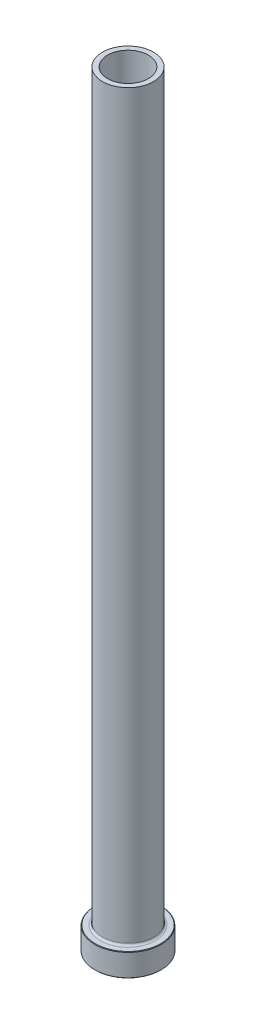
ISO-10303-21;
HEADER;
FILE_DESCRIPTION(('STEP AP214'),'2;1');
FILE_NAME('part.step','',(''),(''),'','','');
FILE_SCHEMA(('AUTOMOTIVE_DESIGN { 1 0 10303 214 1 1 1 1 }'));
ENDSEC;
DATA;
#1=APPLICATION_CONTEXT('core data for automotive mechanical design processes');
#2=APPLICATION_PROTOCOL_DEFINITION('international standard','automotive_design',2000,#1);
#3=PRODUCT_CONTEXT('',#1,'mechanical');
#4=PRODUCT('Part','Part','',(#3));
#5=PRODUCT_RELATED_PRODUCT_CATEGORY('part','',(#4));
#6=PRODUCT_DEFINITION_FORMATION('','',#4);
#7=PRODUCT_DEFINITION_CONTEXT('part definition',#1,'design');
#8=PRODUCT_DEFINITION('design','',#6,#7);
#9=PRODUCT_DEFINITION_SHAPE('','',#8);
#10=(LENGTH_UNIT() NAMED_UNIT(*) SI_UNIT(.MILLI.,.METRE.));
#11=(NAMED_UNIT(*) PLANE_ANGLE_UNIT() SI_UNIT($,.RADIAN.));
#12=(NAMED_UNIT(*) SI_UNIT($,.STERADIAN.) SOLID_ANGLE_UNIT());
#13=UNCERTAINTY_MEASURE_WITH_UNIT(LENGTH_MEASURE(1.E-05),#10,'distance_accuracy_value','');
#14=(GEOMETRIC_REPRESENTATION_CONTEXT(3) GLOBAL_UNCERTAINTY_ASSIGNED_CONTEXT((#13)) GLOBAL_UNIT_ASSIGNED_CONTEXT((#10,
#11,#12)) REPRESENTATION_CONTEXT('',''));
#15=CARTESIAN_POINT('',(0.,0.,0.));
#16=DIRECTION('',(0.,0.,1.));
#17=DIRECTION('',(1.,0.,0.));
#18=AXIS2_PLACEMENT_3D('',#15,#16,#17);
#19=CARTESIAN_POINT('',(0.,92.1876809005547,0.));
#20=DIRECTION('',(0.,1.,0.));
#21=DIRECTION('',(0.,0.,1.));
#22=AXIS2_PLACEMENT_3D('',#19,#20,#21);
#23=CYLINDRICAL_SURFACE('',#22,8.00000000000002);
#24=CARTESIAN_POINT('',(0.,300.,0.));
#25=DIRECTION('',(0.,1.,0.));
#26=DIRECTION('',(0.,0.,1.));
#27=AXIS2_PLACEMENT_3D('',#24,#25,#26);
#28=CIRCLE('',#27,8.00000000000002);
#29=CARTESIAN_POINT('',(0.,300.,8.00000000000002));
#30=VERTEX_POINT('',#29);
#31=EDGE_CURVE('E62',#30,#30,#28,.T.);
#32=ORIENTED_EDGE('',*,*,#31,.T.);
#33=EDGE_LOOP('',(#32));
#34=FACE_BOUND('',#33,.T.);
#35=CARTESIAN_POINT('',(0.,245.,0.));
#36=DIRECTION('',(0.,1.,0.));
#37=DIRECTION('',(0.,0.,1.));
#38=AXIS2_PLACEMENT_3D('',#35,#36,#37);
#39=CIRCLE('',#38,8.00000000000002);
#40=CARTESIAN_POINT('',(0.,245.,8.00000000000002));
#41=VERTEX_POINT('',#40);
#42=EDGE_CURVE('E71',#41,#41,#39,.T.);
#43=ORIENTED_EDGE('',*,*,#42,.F.);
#44=EDGE_LOOP('',(#43));
#45=FACE_BOUND('',#44,.T.);
#46=ADVANCED_FACE('F30',(#34,#45),#23,.F.);
#47=CARTESIAN_POINT('',(-8.00000000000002,300.,0.));
#48=DIRECTION('',(0.,1.,0.));
#49=DIRECTION('',(0.,0.,1.));
#50=AXIS2_PLACEMENT_3D('',#47,#48,#49);
#51=PLANE('',#50);
#52=CARTESIAN_POINT('',(0.,300.,0.));
#53=DIRECTION('',(0.,1.,0.));
#54=DIRECTION('',(0.,0.,1.));
#55=AXIS2_PLACEMENT_3D('',#52,#53,#54);
#56=CIRCLE('',#55,10.);
#57=CARTESIAN_POINT('',(0.,300.,10.));
#58=VERTEX_POINT('',#57);
#59=EDGE_CURVE('E65',#58,#58,#56,.T.);
#60=ORIENTED_EDGE('',*,*,#59,.T.);
#61=EDGE_LOOP('',(#60));
#62=FACE_BOUND('',#61,.T.);
#63=ORIENTED_EDGE('',*,*,#31,.F.);
#64=EDGE_LOOP('',(#63));
#65=FACE_BOUND('',#64,.T.);
#66=ADVANCED_FACE('F79',(#62,#65),#51,.T.);
#67=CARTESIAN_POINT('',(0.,92.1876809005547,0.));
#68=DIRECTION('',(0.,1.,0.));
#69=DIRECTION('',(0.,0.,1.));
#70=AXIS2_PLACEMENT_3D('',#67,#68,#69);
#71=CYLINDRICAL_SURFACE('',#70,10.);
#72=CARTESIAN_POINT('',(0.,9.8,0.));
#73=DIRECTION('',(0.,1.,0.));
#74=DIRECTION('',(0.,0.,1.));
#75=AXIS2_PLACEMENT_3D('',#72,#73,#74);
#76=CIRCLE('',#75,10.);
#77=CARTESIAN_POINT('',(0.,9.8,10.));
#78=VERTEX_POINT('',#77);
#79=EDGE_CURVE('E59',#78,#78,#76,.T.);
#80=ORIENTED_EDGE('',*,*,#79,.T.);
#81=EDGE_LOOP('',(#80));
#82=FACE_BOUND('',#81,.T.);
#83=ORIENTED_EDGE('',*,*,#59,.F.);
#84=EDGE_LOOP('',(#83));
#85=FACE_BOUND('',#84,.T.);
#86=ADVANCED_FACE('F85',(#82,#85),#71,.T.);
#87=CARTESIAN_POINT('',(-9.99999999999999,9.,0.));
#88=DIRECTION('',(0.,1.,0.));
#89=DIRECTION('',(0.,0.,1.));
#90=AXIS2_PLACEMENT_3D('',#87,#88,#89);
#91=PLANE('',#90);
#92=CARTESIAN_POINT('',(0.,9.,0.));
#93=DIRECTION('',(0.,1.,0.));
#94=DIRECTION('',(0.,0.,1.));
#95=AXIS2_PLACEMENT_3D('',#92,#93,#94);
#96=CIRCLE('',#95,12.8);
#97=CARTESIAN_POINT('',(0.,9.,12.8));
#98=VERTEX_POINT('',#97);
#99=EDGE_CURVE('E53',#98,#98,#96,.T.);
#100=ORIENTED_EDGE('',*,*,#99,.T.);
#101=EDGE_LOOP('',(#100));
#102=FACE_BOUND('',#101,.T.);
#103=CARTESIAN_POINT('',(0.,9.,0.));
#104=DIRECTION('',(0.,1.,0.));
#105=DIRECTION('',(0.,0.,1.));
#106=AXIS2_PLACEMENT_3D('',#103,#104,#105);
#107=CIRCLE('',#106,10.8);
#108=CARTESIAN_POINT('',(0.,9.,10.8));
#109=VERTEX_POINT('',#108);
#110=EDGE_CURVE('E56',#109,#109,#107,.F.);
#111=ORIENTED_EDGE('',*,*,#110,.T.);
#112=EDGE_LOOP('',(#111));
#113=FACE_BOUND('',#112,.T.);
#114=ADVANCED_FACE('F111',(#102,#113),#91,.T.);
#115=CARTESIAN_POINT('',(0.,92.1876809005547,0.));
#116=DIRECTION('',(0.,1.,0.));
#117=DIRECTION('',(0.,0.,1.));
#118=AXIS2_PLACEMENT_3D('',#115,#116,#117);
#119=CYLINDRICAL_SURFACE('',#118,13.);
#120=CARTESIAN_POINT('',(0.,8.8,0.));
#121=DIRECTION('',(0.,1.,0.));
#122=DIRECTION('',(0.,0.,1.));
#123=AXIS2_PLACEMENT_3D('',#120,#121,#122);
#124=CIRCLE('',#123,13.);
#125=CARTESIAN_POINT('',(0.,8.8,13.));
#126=VERTEX_POINT('',#125);
#127=EDGE_CURVE('E45',#126,#126,#124,.F.);
#128=ORIENTED_EDGE('',*,*,#127,.T.);
#129=EDGE_LOOP('',(#128));
#130=FACE_BOUND('',#129,.T.);
#131=CARTESIAN_POINT('',(0.,0.20000000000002,0.));
#132=DIRECTION('',(0.,-1.,0.));
#133=DIRECTION('',(0.,0.,-1.));
#134=AXIS2_PLACEMENT_3D('',#131,#132,#133);
#135=CIRCLE('',#134,13.);
#136=CARTESIAN_POINT('',(0.,0.20000000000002,-13.));
#137=VERTEX_POINT('',#136);
#138=EDGE_CURVE('E50',#137,#137,#135,.F.);
#139=ORIENTED_EDGE('',*,*,#138,.T.);
#140=EDGE_LOOP('',(#139));
#141=FACE_BOUND('',#140,.T.);
#142=ADVANCED_FACE('F108',(#130,#141),#119,.T.);
#143=CARTESIAN_POINT('',(-13.,0.,0.));
#144=DIRECTION('',(0.,-1.,0.));
#145=DIRECTION('',(0.,0.,-1.));
#146=AXIS2_PLACEMENT_3D('',#143,#144,#145);
#147=PLANE('',#146);
#148=CARTESIAN_POINT('',(0.,0.,0.));
#149=DIRECTION('',(0.,-1.,0.));
#150=DIRECTION('',(0.,0.,-1.));
#151=AXIS2_PLACEMENT_3D('',#148,#149,#150);
#152=CIRCLE('',#151,8.74999999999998);
#153=CARTESIAN_POINT('',(0.,0.,-8.74999999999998));
#154=VERTEX_POINT('',#153);
#155=EDGE_CURVE('E37',#154,#154,#152,.F.);
#156=ORIENTED_EDGE('',*,*,#155,.T.);
#157=EDGE_LOOP('',(#156));
#158=FACE_BOUND('',#157,.T.);
#159=CARTESIAN_POINT('',(0.,0.,0.));
#160=DIRECTION('',(0.,-1.,0.));
#161=DIRECTION('',(0.,0.,-1.));
#162=AXIS2_PLACEMENT_3D('',#159,#160,#161);
#163=CIRCLE('',#162,12.8);
#164=CARTESIAN_POINT('',(0.,0.,-12.8));
#165=VERTEX_POINT('',#164);
#166=EDGE_CURVE('E41',#165,#165,#163,.T.);
#167=ORIENTED_EDGE('',*,*,#166,.T.);
#168=EDGE_LOOP('',(#167));
#169=FACE_BOUND('',#168,.T.);
#170=ADVANCED_FACE('F110',(#158,#169),#147,.T.);
#171=CARTESIAN_POINT('',(0.,92.1876809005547,0.));
#172=DIRECTION('',(0.,1.,0.));
#173=DIRECTION('',(0.,0.,1.));
#174=AXIS2_PLACEMENT_3D('',#171,#172,#173);
#175=CYLINDRICAL_SURFACE('',#174,8.25);
#176=CARTESIAN_POINT('',(0.,0.499999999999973,0.));
#177=DIRECTION('',(0.,-1.,0.));
#178=DIRECTION('',(0.,0.,-1.));
#179=AXIS2_PLACEMENT_3D('',#176,#177,#178);
#180=CIRCLE('',#179,8.25);
#181=CARTESIAN_POINT('',(0.,0.499999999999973,-8.25));
#182=VERTEX_POINT('',#181);
#183=EDGE_CURVE('E10',#182,#182,#180,.T.);
#184=ORIENTED_EDGE('',*,*,#183,.T.);
#185=EDGE_LOOP('',(#184));
#186=FACE_BOUND('',#185,.T.);
#187=CARTESIAN_POINT('',(0.,233.,0.));
#188=DIRECTION('',(0.,1.,0.));
#189=DIRECTION('',(0.,0.,1.));
#190=AXIS2_PLACEMENT_3D('',#187,#188,#189);
#191=CIRCLE('',#190,8.25000000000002);
#192=CARTESIAN_POINT('',(0.,233.,8.25000000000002));
#193=VERTEX_POINT('',#192);
#194=EDGE_CURVE('E68',#193,#193,#191,.T.);
#195=ORIENTED_EDGE('',*,*,#194,.T.);
#196=EDGE_LOOP('',(#195));
#197=FACE_BOUND('',#196,.T.);
#198=ADVANCED_FACE('F118',(#186,#197),#175,.F.);
#199=CARTESIAN_POINT('',(0.,233.,0.));
#200=DIRECTION('',(0.,-1.,0.));
#201=DIRECTION('',(0.,0.,-1.));
#202=AXIS2_PLACEMENT_3D('',#199,#200,#201);
#203=CONICAL_SURFACE('',#202,8.25000000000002,0.0208303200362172);
#204=ORIENTED_EDGE('',*,*,#42,.T.);
#205=EDGE_LOOP('',(#204));
#206=FACE_BOUND('',#205,.T.);
#207=ORIENTED_EDGE('',*,*,#194,.F.);
#208=EDGE_LOOP('',(#207));
#209=FACE_BOUND('',#208,.T.);
#210=ADVANCED_FACE('F75',(#206,#209),#203,.F.);
#211=CARTESIAN_POINT('',(0.,9.8,0.));
#212=DIRECTION('',(0.,1.,0.));
#213=DIRECTION('',(0.,0.,1.));
#214=AXIS2_PLACEMENT_3D('',#211,#212,#213);
#215=TOROIDAL_SURFACE('',#214,10.8,0.8);
#216=ORIENTED_EDGE('',*,*,#110,.F.);
#217=EDGE_LOOP('',(#216));
#218=FACE_BOUND('',#217,.T.);
#219=ORIENTED_EDGE('',*,*,#79,.F.);
#220=EDGE_LOOP('',(#219));
#221=FACE_BOUND('',#220,.T.);
#222=ADVANCED_FACE('F90',(#218,#221),#215,.F.);
#223=CARTESIAN_POINT('',(0.,8.99999999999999,0.));
#224=DIRECTION('',(0.,-1.,0.));
#225=DIRECTION('',(0.,0.,-1.));
#226=AXIS2_PLACEMENT_3D('',#223,#224,#225);
#227=CONICAL_SURFACE('',#226,12.8,0.785398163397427);
#228=ORIENTED_EDGE('',*,*,#127,.F.);
#229=EDGE_LOOP('',(#228));
#230=FACE_BOUND('',#229,.T.);
#231=ORIENTED_EDGE('',*,*,#99,.F.);
#232=EDGE_LOOP('',(#231));
#233=FACE_BOUND('',#232,.T.);
#234=ADVANCED_FACE('F93',(#230,#233),#227,.T.);
#235=CARTESIAN_POINT('',(0.,0.20000000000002,0.));
#236=DIRECTION('',(0.,1.,0.));
#237=DIRECTION('',(0.,0.,1.));
#238=AXIS2_PLACEMENT_3D('',#235,#236,#237);
#239=CONICAL_SURFACE('',#238,13.,0.785398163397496);
#240=ORIENTED_EDGE('',*,*,#166,.F.);
#241=EDGE_LOOP('',(#240));
#242=FACE_BOUND('',#241,.T.);
#243=ORIENTED_EDGE('',*,*,#138,.F.);
#244=EDGE_LOOP('',(#243));
#245=FACE_BOUND('',#244,.T.);
#246=ADVANCED_FACE('F96',(#242,#245),#239,.T.);
#247=CARTESIAN_POINT('',(0.,0.,0.));
#248=DIRECTION('',(0.,-1.,0.));
#249=DIRECTION('',(0.,0.,-1.));
#250=AXIS2_PLACEMENT_3D('',#247,#248,#249);
#251=CONICAL_SURFACE('',#250,8.74999999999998,0.785398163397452);
#252=ORIENTED_EDGE('',*,*,#183,.F.);
#253=EDGE_LOOP('',(#252));
#254=FACE_BOUND('',#253,.T.);
#255=ORIENTED_EDGE('',*,*,#155,.F.);
#256=EDGE_LOOP('',(#255));
#257=FACE_BOUND('',#256,.T.);
#258=ADVANCED_FACE('F32',(#254,#257),#251,.F.);
#259=CLOSED_SHELL('',(#46,#66,#86,#114,#142,#170,#198,#210,#222,#234,#246,#258));
#260=MANIFOLD_SOLID_BREP('B2',#259);
#261=ADVANCED_BREP_SHAPE_REPRESENTATION('',(#18,#260),#14);
#262=SHAPE_DEFINITION_REPRESENTATION(#9,#261);
ENDSEC;
END-ISO-10303-21;
